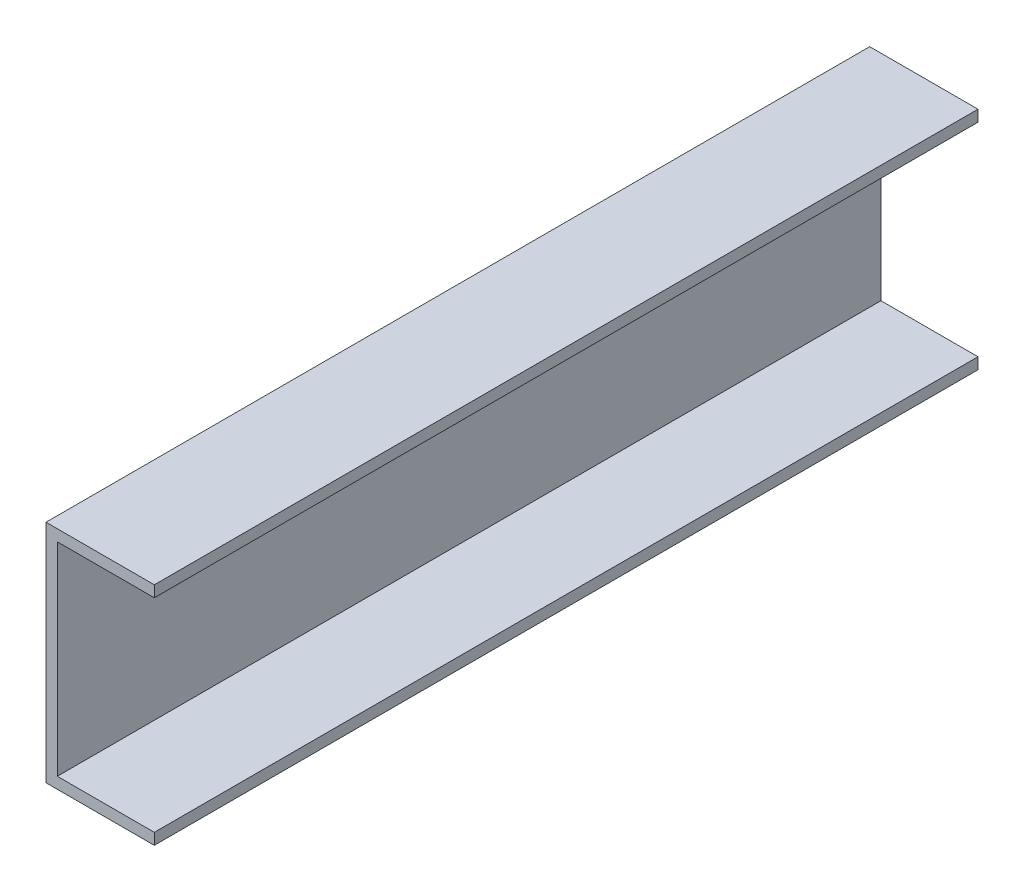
from build123d import *

# Parameters (mm, degrees)
BOSS_EXTRUDE1_DEPTH = 182.5


with BuildPart() as part:
    # Sketch1 → Boss-Extrude1 (new, symmetric)
    with BuildSketch(Plane.XY):
        Polygon((48, 0), (0, 0), (0, 100), (48, 100), (48, 95), (5, 95), (5, 5), (48, 5), align=None)
    extrude(amount=BOSS_EXTRUDE1_DEPTH, both=True)


solid = part.part
